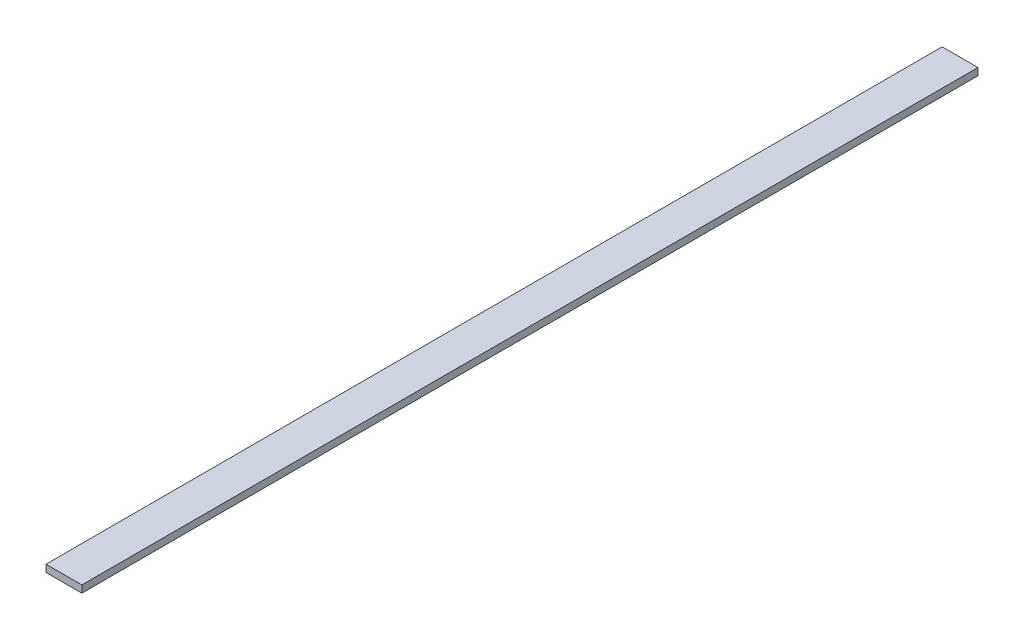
ISO-10303-21;
HEADER;
FILE_DESCRIPTION(('STEP AP214'),'2;1');
FILE_NAME('part.step','',(''),(''),'','','');
FILE_SCHEMA(('AUTOMOTIVE_DESIGN { 1 0 10303 214 1 1 1 1 }'));
ENDSEC;
DATA;
#1=APPLICATION_CONTEXT('core data for automotive mechanical design processes');
#2=APPLICATION_PROTOCOL_DEFINITION('international standard','automotive_design',2000,#1);
#3=PRODUCT_CONTEXT('',#1,'mechanical');
#4=PRODUCT('Part','Part','',(#3));
#5=PRODUCT_RELATED_PRODUCT_CATEGORY('part','',(#4));
#6=PRODUCT_DEFINITION_FORMATION('','',#4);
#7=PRODUCT_DEFINITION_CONTEXT('part definition',#1,'design');
#8=PRODUCT_DEFINITION('design','',#6,#7);
#9=PRODUCT_DEFINITION_SHAPE('','',#8);
#10=(LENGTH_UNIT() NAMED_UNIT(*) SI_UNIT(.MILLI.,.METRE.));
#11=(NAMED_UNIT(*) PLANE_ANGLE_UNIT() SI_UNIT($,.RADIAN.));
#12=(NAMED_UNIT(*) SI_UNIT($,.STERADIAN.) SOLID_ANGLE_UNIT());
#13=UNCERTAINTY_MEASURE_WITH_UNIT(LENGTH_MEASURE(1.E-05),#10,'distance_accuracy_value','');
#14=(GEOMETRIC_REPRESENTATION_CONTEXT(3) GLOBAL_UNCERTAINTY_ASSIGNED_CONTEXT((#13)) GLOBAL_UNIT_ASSIGNED_CONTEXT((#10,
#11,#12)) REPRESENTATION_CONTEXT('',''));
#15=CARTESIAN_POINT('',(0.,0.,0.));
#16=DIRECTION('',(0.,0.,1.));
#17=DIRECTION('',(1.,0.,0.));
#18=AXIS2_PLACEMENT_3D('',#15,#16,#17);
#19=CARTESIAN_POINT('',(-10.,4.,1900.));
#20=DIRECTION('',(1.,0.,0.));
#21=DIRECTION('',(0.,0.,-1.));
#22=AXIS2_PLACEMENT_3D('',#19,#20,#21);
#23=PLANE('',#22);
#24=DIRECTION('',(0.,-1.,0.));
#25=VECTOR('',#24,1.);
#26=CARTESIAN_POINT('',(-10.,4.,500.));
#27=LINE('',#26,#25);
#28=CARTESIAN_POINT('',(-10.,4.,500.));
#29=VERTEX_POINT('',#28);
#30=CARTESIAN_POINT('',(-10.,0.,500.));
#31=VERTEX_POINT('',#30);
#32=EDGE_CURVE('E54',#29,#31,#27,.T.);
#33=ORIENTED_EDGE('',*,*,#32,.F.);
#34=DIRECTION('',(0.,0.,-1.));
#35=VECTOR('',#34,1.);
#36=CARTESIAN_POINT('',(-10.,4.,1900.));
#37=LINE('',#36,#35);
#38=CARTESIAN_POINT('',(-10.,4.,0.));
#39=VERTEX_POINT('',#38);
#40=EDGE_CURVE('E36',#29,#39,#37,.T.);
#41=ORIENTED_EDGE('',*,*,#40,.T.);
#42=DIRECTION('',(0.,-1.,0.));
#43=VECTOR('',#42,1.);
#44=CARTESIAN_POINT('',(-10.,4.,0.));
#45=LINE('',#44,#43);
#46=CARTESIAN_POINT('',(-10.,0.,0.));
#47=VERTEX_POINT('',#46);
#48=EDGE_CURVE('E83',#39,#47,#45,.T.);
#49=ORIENTED_EDGE('',*,*,#48,.T.);
#50=DIRECTION('',(0.,0.,-1.));
#51=VECTOR('',#50,1.);
#52=CARTESIAN_POINT('',(-10.,0.,1900.));
#53=LINE('',#52,#51);
#54=EDGE_CURVE('E9',#31,#47,#53,.T.);
#55=ORIENTED_EDGE('',*,*,#54,.F.);
#56=EDGE_LOOP('',(#33,#41,#49,#55));
#57=FACE_BOUND('',#56,.T.);
#58=ADVANCED_FACE('F14',(#57),#23,.F.);
#59=CARTESIAN_POINT('',(-10.,0.,1900.));
#60=DIRECTION('',(0.,1.,0.));
#61=DIRECTION('',(0.,0.,1.));
#62=AXIS2_PLACEMENT_3D('',#59,#60,#61);
#63=PLANE('',#62);
#64=DIRECTION('',(1.,0.,0.));
#65=VECTOR('',#64,1.);
#66=CARTESIAN_POINT('',(-10.,0.,500.));
#67=LINE('',#66,#65);
#68=CARTESIAN_POINT('',(10.,0.,500.));
#69=VERTEX_POINT('',#68);
#70=EDGE_CURVE('E60',#31,#69,#67,.T.);
#71=ORIENTED_EDGE('',*,*,#70,.F.);
#72=ORIENTED_EDGE('',*,*,#54,.T.);
#73=DIRECTION('',(1.,0.,0.));
#74=VECTOR('',#73,1.);
#75=CARTESIAN_POINT('',(-10.,0.,0.));
#76=LINE('',#75,#74);
#77=CARTESIAN_POINT('',(10.,0.,0.));
#78=VERTEX_POINT('',#77);
#79=EDGE_CURVE('E80',#47,#78,#76,.T.);
#80=ORIENTED_EDGE('',*,*,#79,.T.);
#81=DIRECTION('',(0.,0.,-1.));
#82=VECTOR('',#81,1.);
#83=CARTESIAN_POINT('',(10.,0.,1900.));
#84=LINE('',#83,#82);
#85=EDGE_CURVE('E21',#69,#78,#84,.T.);
#86=ORIENTED_EDGE('',*,*,#85,.F.);
#87=EDGE_LOOP('',(#71,#72,#80,#86));
#88=FACE_BOUND('',#87,.T.);
#89=ADVANCED_FACE('F81',(#88),#63,.F.);
#90=CARTESIAN_POINT('',(10.,4.,1900.));
#91=DIRECTION('',(-1.,0.,0.));
#92=DIRECTION('',(0.,0.,1.));
#93=AXIS2_PLACEMENT_3D('',#90,#91,#92);
#94=PLANE('',#93);
#95=DIRECTION('',(0.,1.,0.));
#96=VECTOR('',#95,1.);
#97=CARTESIAN_POINT('',(10.,0.,500.));
#98=LINE('',#97,#96);
#99=CARTESIAN_POINT('',(10.,4.,500.));
#100=VERTEX_POINT('',#99);
#101=EDGE_CURVE('E28',#69,#100,#98,.T.);
#102=ORIENTED_EDGE('',*,*,#101,.F.);
#103=ORIENTED_EDGE('',*,*,#85,.T.);
#104=DIRECTION('',(0.,1.,0.));
#105=VECTOR('',#104,1.);
#106=CARTESIAN_POINT('',(10.,4.,0.));
#107=LINE('',#106,#105);
#108=CARTESIAN_POINT('',(10.,4.,0.));
#109=VERTEX_POINT('',#108);
#110=EDGE_CURVE('E69',#78,#109,#107,.T.);
#111=ORIENTED_EDGE('',*,*,#110,.T.);
#112=DIRECTION('',(0.,0.,-1.));
#113=VECTOR('',#112,1.);
#114=CARTESIAN_POINT('',(10.,4.,1900.));
#115=LINE('',#114,#113);
#116=EDGE_CURVE('E66',#100,#109,#115,.T.);
#117=ORIENTED_EDGE('',*,*,#116,.F.);
#118=EDGE_LOOP('',(#102,#103,#111,#117));
#119=FACE_BOUND('',#118,.T.);
#120=ADVANCED_FACE('F76',(#119),#94,.F.);
#121=CARTESIAN_POINT('',(-10.,4.,1900.));
#122=DIRECTION('',(0.,-1.,0.));
#123=DIRECTION('',(0.,0.,-1.));
#124=AXIS2_PLACEMENT_3D('',#121,#122,#123);
#125=PLANE('',#124);
#126=DIRECTION('',(-1.,0.,0.));
#127=VECTOR('',#126,1.);
#128=CARTESIAN_POINT('',(10.,4.,500.));
#129=LINE('',#128,#127);
#130=EDGE_CURVE('E52',#100,#29,#129,.T.);
#131=ORIENTED_EDGE('',*,*,#130,.F.);
#132=ORIENTED_EDGE('',*,*,#116,.T.);
#133=DIRECTION('',(-1.,0.,0.));
#134=VECTOR('',#133,1.);
#135=CARTESIAN_POINT('',(-10.,4.,0.));
#136=LINE('',#135,#134);
#137=EDGE_CURVE('E64',#109,#39,#136,.T.);
#138=ORIENTED_EDGE('',*,*,#137,.T.);
#139=ORIENTED_EDGE('',*,*,#40,.F.);
#140=EDGE_LOOP('',(#131,#132,#138,#139));
#141=FACE_BOUND('',#140,.T.);
#142=ADVANCED_FACE('F62',(#141),#125,.F.);
#143=CARTESIAN_POINT('',(-10.,0.,0.));
#144=DIRECTION('',(0.,0.,1.));
#145=DIRECTION('',(1.,0.,0.));
#146=AXIS2_PLACEMENT_3D('',#143,#144,#145);
#147=PLANE('',#146);
#148=ORIENTED_EDGE('',*,*,#48,.F.);
#149=ORIENTED_EDGE('',*,*,#137,.F.);
#150=ORIENTED_EDGE('',*,*,#110,.F.);
#151=ORIENTED_EDGE('',*,*,#79,.F.);
#152=EDGE_LOOP('',(#148,#149,#150,#151));
#153=FACE_BOUND('',#152,.T.);
#154=ADVANCED_FACE('F85',(#153),#147,.F.);
#155=CARTESIAN_POINT('',(-10.,4.,500.));
#156=DIRECTION('',(0.,0.,1.));
#157=DIRECTION('',(1.,0.,0.));
#158=AXIS2_PLACEMENT_3D('',#155,#156,#157);
#159=PLANE('',#158);
#160=ORIENTED_EDGE('',*,*,#130,.T.);
#161=ORIENTED_EDGE('',*,*,#32,.T.);
#162=ORIENTED_EDGE('',*,*,#70,.T.);
#163=ORIENTED_EDGE('',*,*,#101,.T.);
#164=EDGE_LOOP('',(#160,#161,#162,#163));
#165=FACE_BOUND('',#164,.T.);
#166=ADVANCED_FACE('F53',(#165),#159,.T.);
#167=CLOSED_SHELL('',(#58,#89,#120,#142,#154,#166));
#168=MANIFOLD_SOLID_BREP('B1',#167);
#169=ADVANCED_BREP_SHAPE_REPRESENTATION('',(#18,#168),#14);
#170=SHAPE_DEFINITION_REPRESENTATION(#9,#169);
ENDSEC;
END-ISO-10303-21;
